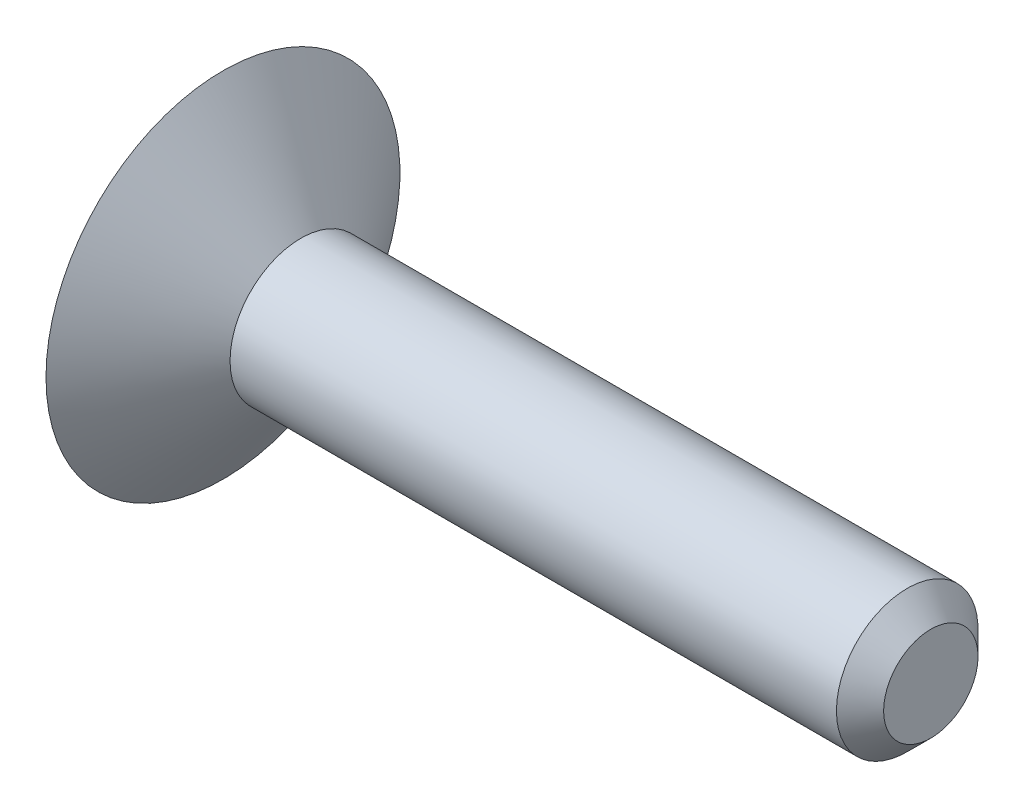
ISO-10303-21;
HEADER;
FILE_DESCRIPTION(('STEP AP214'),'2;1');
FILE_NAME('part.step','',(''),(''),'','','');
FILE_SCHEMA(('AUTOMOTIVE_DESIGN { 1 0 10303 214 1 1 1 1 }'));
ENDSEC;
DATA;
#1=APPLICATION_CONTEXT('core data for automotive mechanical design processes');
#2=APPLICATION_PROTOCOL_DEFINITION('international standard','automotive_design',2000,#1);
#3=PRODUCT_CONTEXT('',#1,'mechanical');
#4=PRODUCT('Part','Part','',(#3));
#5=PRODUCT_RELATED_PRODUCT_CATEGORY('part','',(#4));
#6=PRODUCT_DEFINITION_FORMATION('','',#4);
#7=PRODUCT_DEFINITION_CONTEXT('part definition',#1,'design');
#8=PRODUCT_DEFINITION('design','',#6,#7);
#9=PRODUCT_DEFINITION_SHAPE('','',#8);
#10=(LENGTH_UNIT() NAMED_UNIT(*) SI_UNIT(.MILLI.,.METRE.));
#11=(NAMED_UNIT(*) PLANE_ANGLE_UNIT() SI_UNIT($,.RADIAN.));
#12=(NAMED_UNIT(*) SI_UNIT($,.STERADIAN.) SOLID_ANGLE_UNIT());
#13=UNCERTAINTY_MEASURE_WITH_UNIT(LENGTH_MEASURE(1.E-05),#10,'distance_accuracy_value','');
#14=(GEOMETRIC_REPRESENTATION_CONTEXT(3) GLOBAL_UNCERTAINTY_ASSIGNED_CONTEXT((#13)) GLOBAL_UNIT_ASSIGNED_CONTEXT((#10,
#11,#12)) REPRESENTATION_CONTEXT('',''));
#15=CARTESIAN_POINT('',(0.,0.,0.));
#16=DIRECTION('',(0.,0.,1.));
#17=DIRECTION('',(1.,0.,0.));
#18=AXIS2_PLACEMENT_3D('',#15,#16,#17);
#19=CARTESIAN_POINT('',(0.,0.,0.));
#20=DIRECTION('',(-1.,0.,0.));
#21=DIRECTION('',(0.,0.,1.));
#22=AXIS2_PLACEMENT_3D('',#19,#20,#21);
#23=PLANE('',#22);
#24=CARTESIAN_POINT('',(0.,0.,0.));
#25=DIRECTION('',(-1.,0.,0.));
#26=DIRECTION('',(0.,0.,1.));
#27=AXIS2_PLACEMENT_3D('',#24,#25,#26);
#28=CIRCLE('',#27,7.5);
#29=CARTESIAN_POINT('',(0.,0.,7.5));
#30=VERTEX_POINT('',#29);
#31=EDGE_CURVE('E11',#30,#30,#28,.T.);
#32=ORIENTED_EDGE('',*,*,#31,.T.);
#33=EDGE_LOOP('',(#32));
#34=FACE_BOUND('',#33,.T.);
#35=DIRECTION('',(0.,0.909373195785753,-0.415981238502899));
#36=VECTOR('',#35,1.);
#37=CARTESIAN_POINT('',(0.,-2.19361678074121,-1.89600279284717));
#38=LINE('',#37,#36);
#39=CARTESIAN_POINT('',(0.,-2.19361678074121,-1.89600279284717));
#40=VERTEX_POINT('',#39);
#41=CARTESIAN_POINT('',(0.,0.,-2.89944497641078));
#42=VERTEX_POINT('',#41);
#43=EDGE_CURVE('E104',#40,#42,#38,.T.);
#44=ORIENTED_EDGE('',*,*,#43,.T.);
#45=DIRECTION('',(0.,0.862233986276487,0.506510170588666));
#46=VECTOR('',#45,1.);
#47=CARTESIAN_POINT('',(0.,0.,-2.89944497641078));
#48=LINE('',#47,#46);
#49=CARTESIAN_POINT('',(0.,2.53255085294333,-1.41172495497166));
#50=VERTEX_POINT('',#49);
#51=EDGE_CURVE('E45',#42,#50,#48,.T.);
#52=ORIENTED_EDGE('',*,*,#51,.T.);
#53=DIRECTION('',(0.,-0.101933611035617,0.994791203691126));
#54=VECTOR('',#53,1.);
#55=CARTESIAN_POINT('',(0.,2.53255085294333,-1.41172495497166));
#56=LINE('',#55,#54);
#57=CARTESIAN_POINT('',(0.,2.19361678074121,1.89600279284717));
#58=VERTEX_POINT('',#57);
#59=EDGE_CURVE('E85',#50,#58,#56,.T.);
#60=ORIENTED_EDGE('',*,*,#59,.T.);
#61=DIRECTION('',(0.,-0.909373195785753,0.415981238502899));
#62=VECTOR('',#61,1.);
#63=CARTESIAN_POINT('',(0.,2.19361678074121,1.89600279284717));
#64=LINE('',#63,#62);
#65=CARTESIAN_POINT('',(0.,0.,2.89944497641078));
#66=VERTEX_POINT('',#65);
#67=EDGE_CURVE('E93',#58,#66,#64,.T.);
#68=ORIENTED_EDGE('',*,*,#67,.T.);
#69=DIRECTION('',(0.,-0.862233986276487,-0.506510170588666));
#70=VECTOR('',#69,1.);
#71=CARTESIAN_POINT('',(0.,0.,2.89944497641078));
#72=LINE('',#71,#70);
#73=CARTESIAN_POINT('',(0.,-2.53255085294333,1.41172495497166));
#74=VERTEX_POINT('',#73);
#75=EDGE_CURVE('E108',#66,#74,#72,.T.);
#76=ORIENTED_EDGE('',*,*,#75,.T.);
#77=DIRECTION('',(0.,0.101933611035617,-0.994791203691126));
#78=VECTOR('',#77,1.);
#79=CARTESIAN_POINT('',(0.,-2.53255085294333,1.41172495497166));
#80=LINE('',#79,#78);
#81=EDGE_CURVE('E111',#74,#40,#80,.T.);
#82=ORIENTED_EDGE('',*,*,#81,.T.);
#83=EDGE_LOOP('',(#44,#52,#60,#68,#76,#82));
#84=FACE_BOUND('',#83,.T.);
#85=ADVANCED_FACE('F31',(#34,#84),#23,.T.);
#86=CARTESIAN_POINT('',(0.,0.,0.));
#87=DIRECTION('',(-1.,0.,0.));
#88=DIRECTION('',(0.,0.,1.));
#89=AXIS2_PLACEMENT_3D('',#86,#87,#88);
#90=CONICAL_SURFACE('',#89,7.5,0.938047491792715);
#91=CARTESIAN_POINT('',(3.3,0.,0.));
#92=DIRECTION('',(-1.,0.,0.));
#93=DIRECTION('',(0.,0.,1.));
#94=AXIS2_PLACEMENT_3D('',#91,#92,#93);
#95=CIRCLE('',#94,2.99999999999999);
#96=CARTESIAN_POINT('',(3.3,0.,2.99999999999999));
#97=VERTEX_POINT('',#96);
#98=EDGE_CURVE('E38',#97,#97,#95,.T.);
#99=ORIENTED_EDGE('',*,*,#98,.T.);
#100=EDGE_LOOP('',(#99));
#101=FACE_BOUND('',#100,.T.);
#102=ORIENTED_EDGE('',*,*,#31,.F.);
#103=EDGE_LOOP('',(#102));
#104=FACE_BOUND('',#103,.T.);
#105=ADVANCED_FACE('F140',(#101,#104),#90,.T.);
#106=CARTESIAN_POINT('',(-28.5761966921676,0.,0.));
#107=DIRECTION('',(-1.,0.,0.));
#108=DIRECTION('',(0.,0.,1.));
#109=AXIS2_PLACEMENT_3D('',#106,#107,#108);
#110=CYLINDRICAL_SURFACE('',#109,2.99999999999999);
#111=CARTESIAN_POINT('',(29.,0.,0.));
#112=DIRECTION('',(-1.,0.,0.));
#113=DIRECTION('',(0.,0.,1.));
#114=AXIS2_PLACEMENT_3D('',#111,#112,#113);
#115=CIRCLE('',#114,2.99999999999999);
#116=CARTESIAN_POINT('',(29.,0.,2.99999999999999));
#117=VERTEX_POINT('',#116);
#118=EDGE_CURVE('E135',#117,#117,#115,.T.);
#119=ORIENTED_EDGE('',*,*,#118,.T.);
#120=EDGE_LOOP('',(#119));
#121=FACE_BOUND('',#120,.T.);
#122=ORIENTED_EDGE('',*,*,#98,.F.);
#123=EDGE_LOOP('',(#122));
#124=FACE_BOUND('',#123,.T.);
#125=ADVANCED_FACE('F143',(#121,#124),#110,.T.);
#126=CARTESIAN_POINT('',(29.,0.,0.));
#127=DIRECTION('',(-1.,0.,0.));
#128=DIRECTION('',(0.,0.,1.));
#129=AXIS2_PLACEMENT_3D('',#126,#127,#128);
#130=CONICAL_SURFACE('',#129,2.99999999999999,0.785398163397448);
#131=CARTESIAN_POINT('',(30.,0.,0.));
#132=DIRECTION('',(-1.,0.,0.));
#133=DIRECTION('',(0.,0.,1.));
#134=AXIS2_PLACEMENT_3D('',#131,#132,#133);
#135=CIRCLE('',#134,1.99999999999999);
#136=CARTESIAN_POINT('',(30.,0.,1.99999999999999));
#137=VERTEX_POINT('',#136);
#138=EDGE_CURVE('E99',#137,#137,#135,.T.);
#139=ORIENTED_EDGE('',*,*,#138,.T.);
#140=EDGE_LOOP('',(#139));
#141=FACE_BOUND('',#140,.T.);
#142=ORIENTED_EDGE('',*,*,#118,.F.);
#143=EDGE_LOOP('',(#142));
#144=FACE_BOUND('',#143,.T.);
#145=ADVANCED_FACE('F145',(#141,#144),#130,.T.);
#146=CARTESIAN_POINT('',(30.,1.99999999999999,0.));
#147=DIRECTION('',(1.,0.,0.));
#148=DIRECTION('',(0.,0.,-1.));
#149=AXIS2_PLACEMENT_3D('',#146,#147,#148);
#150=PLANE('',#149);
#151=ORIENTED_EDGE('',*,*,#138,.F.);
#152=EDGE_LOOP('',(#151));
#153=FACE_BOUND('',#152,.T.);
#154=ADVANCED_FACE('F152',(#153),#150,.T.);
#155=CARTESIAN_POINT('',(3.,0.,-2.89944497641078));
#156=DIRECTION('',(0.,-0.506510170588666,0.862233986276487));
#157=DIRECTION('',(0.,-0.862233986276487,-0.506510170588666));
#158=AXIS2_PLACEMENT_3D('',#155,#156,#157);
#159=PLANE('',#158);
#160=ORIENTED_EDGE('',*,*,#51,.F.);
#161=DIRECTION('',(-1.,0.,0.));
#162=VECTOR('',#161,1.);
#163=CARTESIAN_POINT('',(3.,0.,-2.89944497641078));
#164=LINE('',#163,#162);
#165=CARTESIAN_POINT('',(3.,0.,-2.89944497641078));
#166=VERTEX_POINT('',#165);
#167=EDGE_CURVE('E124',#166,#42,#164,.T.);
#168=ORIENTED_EDGE('',*,*,#167,.F.);
#169=DIRECTION('',(0.,0.862233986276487,0.506510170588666));
#170=VECTOR('',#169,1.);
#171=CARTESIAN_POINT('',(3.,0.,-2.89944497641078));
#172=LINE('',#171,#170);
#173=CARTESIAN_POINT('',(3.,2.53255085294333,-1.41172495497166));
#174=VERTEX_POINT('',#173);
#175=EDGE_CURVE('E98',#166,#174,#172,.T.);
#176=ORIENTED_EDGE('',*,*,#175,.T.);
#177=DIRECTION('',(-1.,0.,0.));
#178=VECTOR('',#177,1.);
#179=CARTESIAN_POINT('',(3.,2.53255085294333,-1.41172495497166));
#180=LINE('',#179,#178);
#181=EDGE_CURVE('E87',#174,#50,#180,.T.);
#182=ORIENTED_EDGE('',*,*,#181,.T.);
#183=EDGE_LOOP('',(#160,#168,#176,#182));
#184=FACE_BOUND('',#183,.T.);
#185=ADVANCED_FACE('F96',(#184),#159,.T.);
#186=CARTESIAN_POINT('',(3.,2.53255085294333,-1.41172495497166));
#187=DIRECTION('',(0.,-0.994791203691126,-0.101933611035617));
#188=DIRECTION('',(0.,0.101933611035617,-0.994791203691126));
#189=AXIS2_PLACEMENT_3D('',#186,#187,#188);
#190=PLANE('',#189);
#191=ORIENTED_EDGE('',*,*,#59,.F.);
#192=ORIENTED_EDGE('',*,*,#181,.F.);
#193=DIRECTION('',(0.,-0.101933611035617,0.994791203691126));
#194=VECTOR('',#193,1.);
#195=CARTESIAN_POINT('',(3.,2.53255085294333,-1.41172495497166));
#196=LINE('',#195,#194);
#197=CARTESIAN_POINT('',(3.,2.19361678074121,1.89600279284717));
#198=VERTEX_POINT('',#197);
#199=EDGE_CURVE('E115',#174,#198,#196,.T.);
#200=ORIENTED_EDGE('',*,*,#199,.T.);
#201=DIRECTION('',(-1.,0.,0.));
#202=VECTOR('',#201,1.);
#203=CARTESIAN_POINT('',(3.,2.19361678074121,1.89600279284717));
#204=LINE('',#203,#202);
#205=EDGE_CURVE('E89',#198,#58,#204,.T.);
#206=ORIENTED_EDGE('',*,*,#205,.T.);
#207=EDGE_LOOP('',(#191,#192,#200,#206));
#208=FACE_BOUND('',#207,.T.);
#209=ADVANCED_FACE('F86',(#208),#190,.T.);
#210=CARTESIAN_POINT('',(3.,2.19361678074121,1.89600279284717));
#211=DIRECTION('',(0.,-0.415981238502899,-0.909373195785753));
#212=DIRECTION('',(0.,0.909373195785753,-0.415981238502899));
#213=AXIS2_PLACEMENT_3D('',#210,#211,#212);
#214=PLANE('',#213);
#215=ORIENTED_EDGE('',*,*,#67,.F.);
#216=ORIENTED_EDGE('',*,*,#205,.F.);
#217=DIRECTION('',(0.,-0.909373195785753,0.415981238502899));
#218=VECTOR('',#217,1.);
#219=CARTESIAN_POINT('',(3.,2.19361678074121,1.89600279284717));
#220=LINE('',#219,#218);
#221=CARTESIAN_POINT('',(3.,0.,2.89944497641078));
#222=VERTEX_POINT('',#221);
#223=EDGE_CURVE('E117',#198,#222,#220,.T.);
#224=ORIENTED_EDGE('',*,*,#223,.T.);
#225=DIRECTION('',(-1.,0.,0.));
#226=VECTOR('',#225,1.);
#227=CARTESIAN_POINT('',(3.,0.,2.89944497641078));
#228=LINE('',#227,#226);
#229=EDGE_CURVE('E130',#222,#66,#228,.T.);
#230=ORIENTED_EDGE('',*,*,#229,.T.);
#231=EDGE_LOOP('',(#215,#216,#224,#230));
#232=FACE_BOUND('',#231,.T.);
#233=ADVANCED_FACE('F200',(#232),#214,.T.);
#234=CARTESIAN_POINT('',(3.,0.,2.89944497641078));
#235=DIRECTION('',(0.,0.506510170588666,-0.862233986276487));
#236=DIRECTION('',(0.,0.862233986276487,0.506510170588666));
#237=AXIS2_PLACEMENT_3D('',#234,#235,#236);
#238=PLANE('',#237);
#239=ORIENTED_EDGE('',*,*,#75,.F.);
#240=ORIENTED_EDGE('',*,*,#229,.F.);
#241=DIRECTION('',(0.,-0.862233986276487,-0.506510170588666));
#242=VECTOR('',#241,1.);
#243=CARTESIAN_POINT('',(3.,0.,2.89944497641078));
#244=LINE('',#243,#242);
#245=CARTESIAN_POINT('',(3.,-2.53255085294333,1.41172495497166));
#246=VERTEX_POINT('',#245);
#247=EDGE_CURVE('E119',#222,#246,#244,.T.);
#248=ORIENTED_EDGE('',*,*,#247,.T.);
#249=DIRECTION('',(-1.,0.,0.));
#250=VECTOR('',#249,1.);
#251=CARTESIAN_POINT('',(3.,-2.53255085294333,1.41172495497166));
#252=LINE('',#251,#250);
#253=EDGE_CURVE('E128',#246,#74,#252,.T.);
#254=ORIENTED_EDGE('',*,*,#253,.T.);
#255=EDGE_LOOP('',(#239,#240,#248,#254));
#256=FACE_BOUND('',#255,.T.);
#257=ADVANCED_FACE('F209',(#256),#238,.T.);
#258=CARTESIAN_POINT('',(3.,-2.53255085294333,1.41172495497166));
#259=DIRECTION('',(0.,0.994791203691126,0.101933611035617));
#260=DIRECTION('',(0.,-0.101933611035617,0.994791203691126));
#261=AXIS2_PLACEMENT_3D('',#258,#259,#260);
#262=PLANE('',#261);
#263=ORIENTED_EDGE('',*,*,#81,.F.);
#264=ORIENTED_EDGE('',*,*,#253,.F.);
#265=DIRECTION('',(0.,0.101933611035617,-0.994791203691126));
#266=VECTOR('',#265,1.);
#267=CARTESIAN_POINT('',(3.,-2.53255085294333,1.41172495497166));
#268=LINE('',#267,#266);
#269=CARTESIAN_POINT('',(3.,-2.19361678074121,-1.89600279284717));
#270=VERTEX_POINT('',#269);
#271=EDGE_CURVE('E121',#246,#270,#268,.T.);
#272=ORIENTED_EDGE('',*,*,#271,.T.);
#273=DIRECTION('',(-1.,0.,0.));
#274=VECTOR('',#273,1.);
#275=CARTESIAN_POINT('',(3.,-2.19361678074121,-1.89600279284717));
#276=LINE('',#275,#274);
#277=EDGE_CURVE('E126',#270,#40,#276,.T.);
#278=ORIENTED_EDGE('',*,*,#277,.T.);
#279=EDGE_LOOP('',(#263,#264,#272,#278));
#280=FACE_BOUND('',#279,.T.);
#281=ADVANCED_FACE('F219',(#280),#262,.T.);
#282=CARTESIAN_POINT('',(3.,-2.19361678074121,-1.89600279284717));
#283=DIRECTION('',(0.,0.415981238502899,0.909373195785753));
#284=DIRECTION('',(0.,-0.909373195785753,0.415981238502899));
#285=AXIS2_PLACEMENT_3D('',#282,#283,#284);
#286=PLANE('',#285);
#287=ORIENTED_EDGE('',*,*,#43,.F.);
#288=ORIENTED_EDGE('',*,*,#277,.F.);
#289=DIRECTION('',(0.,0.909373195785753,-0.415981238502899));
#290=VECTOR('',#289,1.);
#291=CARTESIAN_POINT('',(3.,-2.19361678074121,-1.89600279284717));
#292=LINE('',#291,#290);
#293=EDGE_CURVE('E52',#270,#166,#292,.T.);
#294=ORIENTED_EDGE('',*,*,#293,.T.);
#295=ORIENTED_EDGE('',*,*,#167,.T.);
#296=EDGE_LOOP('',(#287,#288,#294,#295));
#297=FACE_BOUND('',#296,.T.);
#298=ADVANCED_FACE('F229',(#297),#286,.T.);
#299=CARTESIAN_POINT('',(3.,2.53255085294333,-1.41172495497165));
#300=DIRECTION('',(1.,0.,0.));
#301=DIRECTION('',(0.,0.,-1.));
#302=AXIS2_PLACEMENT_3D('',#299,#300,#301);
#303=PLANE('',#302);
#304=ORIENTED_EDGE('',*,*,#175,.F.);
#305=ORIENTED_EDGE('',*,*,#293,.F.);
#306=ORIENTED_EDGE('',*,*,#271,.F.);
#307=ORIENTED_EDGE('',*,*,#247,.F.);
#308=ORIENTED_EDGE('',*,*,#223,.F.);
#309=ORIENTED_EDGE('',*,*,#199,.F.);
#310=EDGE_LOOP('',(#304,#305,#306,#307,#308,#309));
#311=FACE_BOUND('',#310,.T.);
#312=ADVANCED_FACE('F239',(#311),#303,.F.);
#313=CLOSED_SHELL('',(#85,#105,#125,#145,#154,#185,#209,#233,#257,#281,#298,#312));
#314=MANIFOLD_SOLID_BREP('B2',#313);
#315=ADVANCED_BREP_SHAPE_REPRESENTATION('',(#18,#314),#14);
#316=SHAPE_DEFINITION_REPRESENTATION(#9,#315);
ENDSEC;
END-ISO-10303-21;
